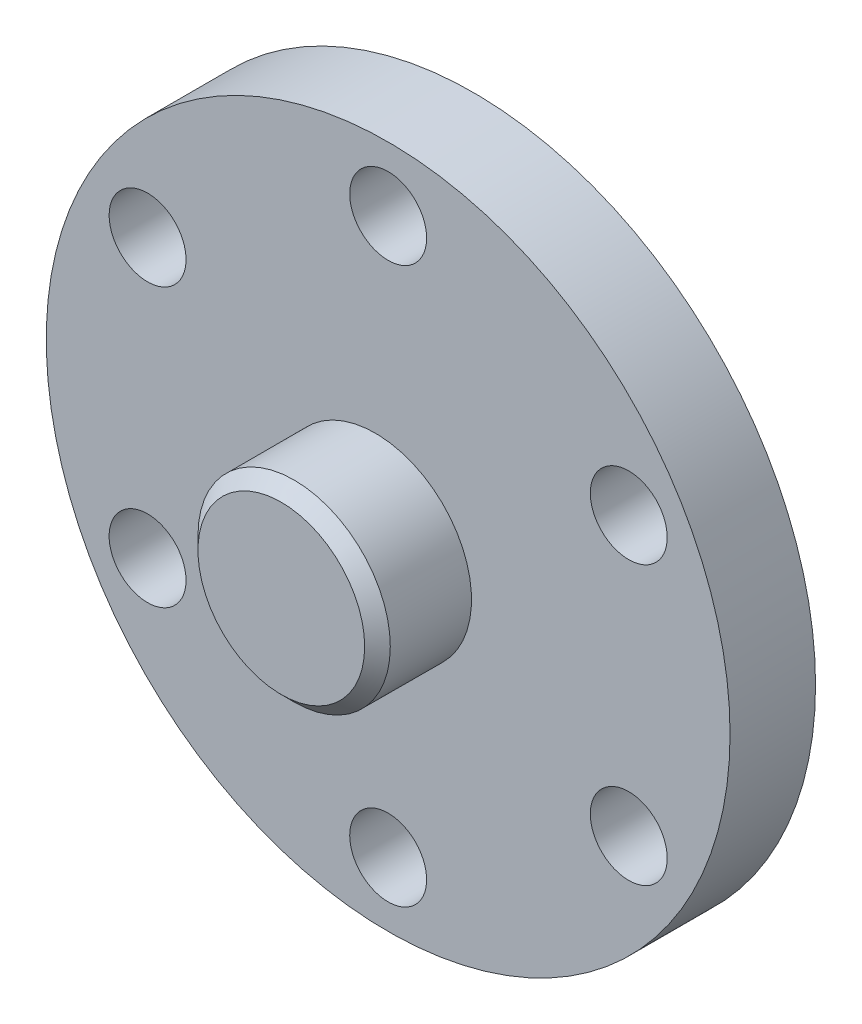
from build123d import *

# Parameters (mm, degrees)
SKETCH1_R          = 80
BASE_EXTRUDE_DEPTH = 20
CHAMFER1_SIZE      = 3
SKETCH3_R          = 9
CUT_EXTRUDE1_DEPTH = 116.866302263
CIRPATTERN1_COUNT  = 6


with BuildPart() as part:
    # Sketch1 → Base-Extrude (new body)
    with BuildSketch(Plane.XY):
        Circle(SKETCH1_R)
    extrude(amount=BASE_EXTRUDE_DEPTH)

    # Sketch2 → Boss-Revolve1 (revolve)
    with BuildSketch(Plane(origin=(0, 0, 0), x_dir=(1, 0, 0), z_dir=(0, 1, 0))):
        Polygon((-10, -20), (-10, -23), (-22.5, -23), (-22.5, -45), (0, -45), (0, -20), align=None)
    revolve(axis=Axis((0, 0, 0), (0, 0, 1)))

    # Chamfer1
    chamfer1_edges = [part.edges().sort_by_distance(p)[0] for p in [
        (22.5, 0, 45),
    ]]
    chamfer(chamfer1_edges, length=CHAMFER1_SIZE)

    # Sketch3 → Cut-Extrude1 (cut, through all)
    with BuildSketch(Plane.XY.offset(20)):
        with Locations((0, 65)):
            Circle(SKETCH3_R)
    cut_extrude1 = extrude(amount=-CUT_EXTRUDE1_DEPTH, mode=Mode.SUBTRACT)

    # CirPattern1: Cut-Extrude1 ×6 about axis
    cirpattern1_axis = Axis((0, 0, 0), (0, 0, 1))
    for i in range(1, CIRPATTERN1_COUNT):
        add(cut_extrude1.rotate(cirpattern1_axis, i * 360 / CIRPATTERN1_COUNT), mode=Mode.SUBTRACT)


solid = part.part
